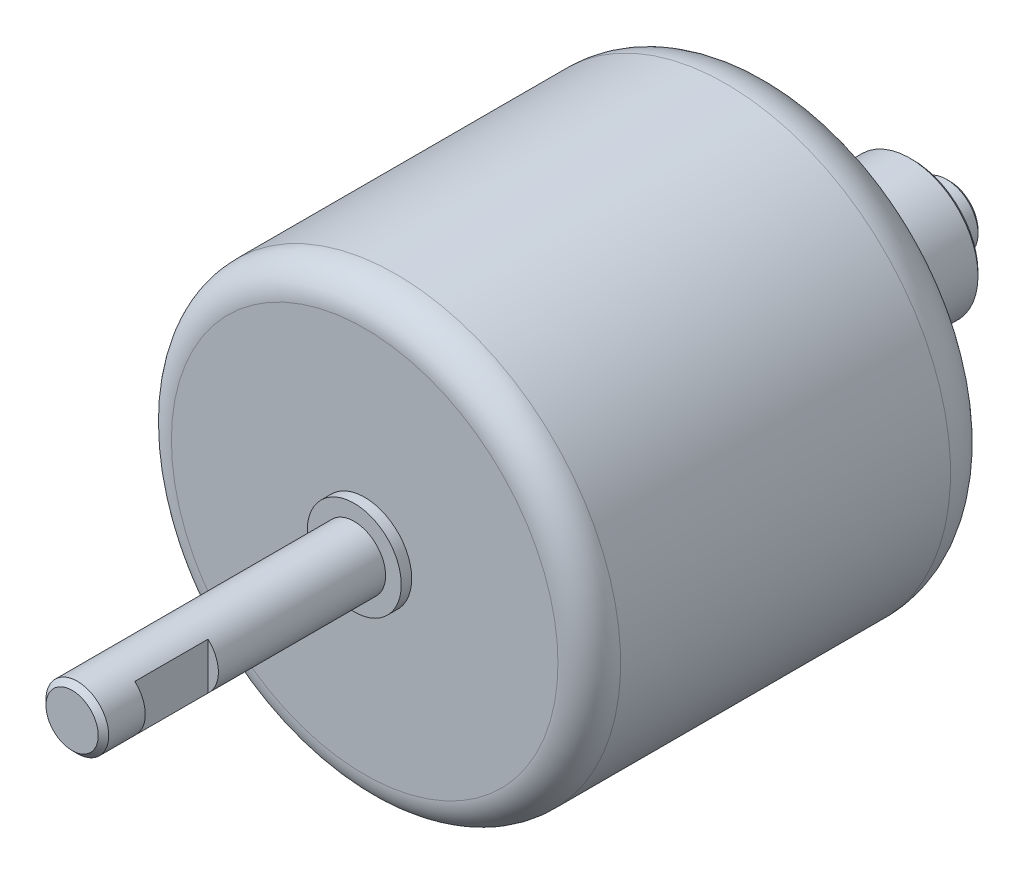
from build123d import *

# Parameters (mm, degrees)
CHANFREIN1_SIZE         = 0.5
ESQUISSE2_W             = 1
ESQUISSE2_H             = 7
ENL_V_MAT_EXTRU_1_DEPTH = 5
CONG_2_R                = 5
CONG_3_R                = 3
CHANFREIN2_SIZE         = 0.3


with BuildPart() as part:
    # Esquisse1 → Base-R_volution (revolve)
    with BuildSketch(Plane(origin=(0, 0, 0), x_dir=(0, 0, -1), z_dir=(1, 0, 0)), mode=Mode.PRIVATE) as base_r_volution_sk:
        Polygon((-56, 4.5), (-57, 4.5), (-57, 3), (-84, 3), (-84, 0), (0, 0), (0, 3), (-3.5, 3), (-3.5, 6.5), (-14.5, 6.5), (-14.5, 14.5), (-18.541451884, 21.5), (-56, 21.5), align=None)
    revolve(base_r_volution_sk.sketch.rotate(Axis((0, 0, 84), (0, 0, -1)), 90), axis=Axis((0, 0, 84), (0, 0, -1)))

    # Chanfrein1
    chanfrein1_edges = [part.edges().sort_by_distance(p)[0] for p in [
        (-3, 0, 84),
    ]]
    chamfer(chanfrein1_edges, length=CHANFREIN1_SIZE)

    # Esquisse2 → Enl_v. mat.-Extru.1 (cut, symmetric)
    with BuildSketch(Plane(origin=(0, 0, 0), x_dir=(1, 0, 0), z_dir=(0, 1, 0))):
        with Locations((2.5, -76.5)):
            Rectangle(ESQUISSE2_W, ESQUISSE2_H)
        with Locations((-2.5, -76.5)):
            Rectangle(ESQUISSE2_W, ESQUISSE2_H)
    extrude(amount=ENL_V_MAT_EXTRU_1_DEPTH, both=True, mode=Mode.SUBTRACT)

    # Cong_2
    cong_2_edges = [part.edges().sort_by_distance(p)[0] for p in [
        (-21.5, 0, 18.541451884),
        (-14.5, 0, 14.5),
    ]]
    fillet(cong_2_edges, radius=CONG_2_R)

    # Cong_3
    cong_3_edges = [part.edges().sort_by_distance(p)[0] for p in [
        (-21.5, 0, 56),
    ]]
    fillet(cong_3_edges, radius=CONG_3_R)

    # Chanfrein2
    chanfrein2_edges = [part.edges().sort_by_distance(p)[0] for p in [
        (-6.5, 0, 3.5),
        (-3, 0, 0),
    ]]
    chamfer(chanfrein2_edges, length=CHANFREIN2_SIZE)


solid = part.part
